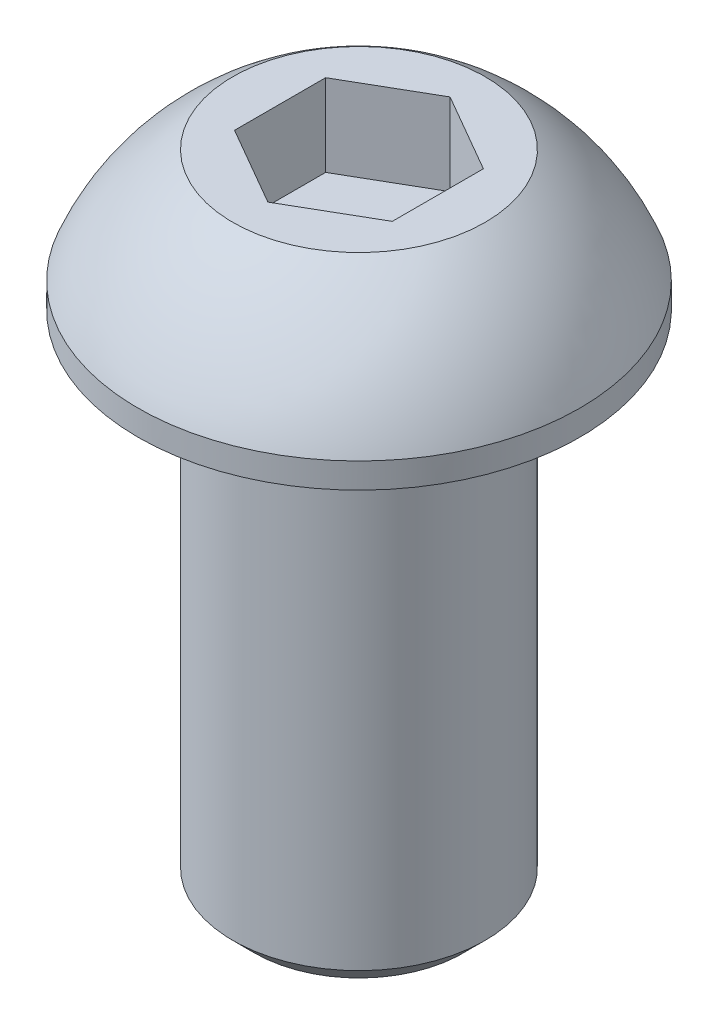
from build123d import *

# Parameters (mm, degrees)
ENL_V_MAT_EXTRU_1_DEPTH = 2.6


with BuildPart() as part:
    # Esquisse1 → Base-R_volution (revolve)
    with BuildSketch(Plane.XY, mode=Mode.PRIVATE) as base_r_volution_sk:
        with BuildLine():
            Line((0, 0), (7, 0))
            Line((7, 0), (7, 0.8))
            ThreePointArc((7, 0.8), (5.787054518, 2.839212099), (4, 4.4))
            Line((4, 4.4), (0, 4.4))
            Line((0, 4.4), (0, 0))
        make_face()
    revolve(base_r_volution_sk.sketch.rotate(Axis((0, 0, 0), (0, 1, 0)), 90), axis=Axis((0, 0, 0), (0, 1, 0)))

    # Esquisse2 → Boss.-R_vol.1 (revolve)
    with BuildSketch(Plane.XY, mode=Mode.PRIVATE) as boss_r_vol_1_sk:
        Polygon((0, -16), (3.3095, -16), (4, -15.3095), (4, 0), (0, 0), align=None)
    revolve(boss_r_vol_1_sk.sketch.rotate(Axis((0, 0, 0), (0, 1, 0)), 90), axis=Axis((0, 0, 0), (0, 1, 0)))

    # Esquisse3 → Enl_v. mat.-Extru.1 (cut)
    with BuildSketch(Plane(origin=(0, 4.4, 0), x_dir=(-1, 0, 0), z_dir=(0, 1, 0))):
        Polygon((2.5, 1.443375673), (0, 2.886751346), (-2.5, 1.443375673), (-2.5, -1.443375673), (0, -2.886751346), (2.5, -1.443375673), align=None)
    extrude(amount=-ENL_V_MAT_EXTRU_1_DEPTH, mode=Mode.SUBTRACT)


solid = part.part
